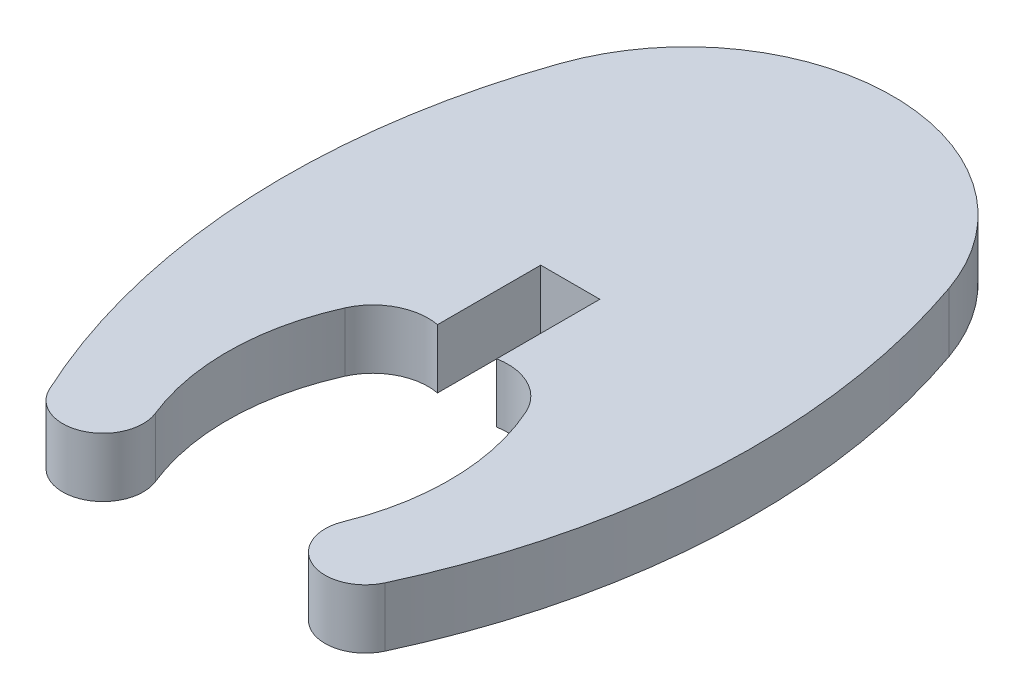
ISO-10303-21;
HEADER;
FILE_DESCRIPTION(('STEP AP214'),'2;1');
FILE_NAME('part.step','',(''),(''),'','','');
FILE_SCHEMA(('AUTOMOTIVE_DESIGN { 1 0 10303 214 1 1 1 1 }'));
ENDSEC;
DATA;
#1=APPLICATION_CONTEXT('core data for automotive mechanical design processes');
#2=APPLICATION_PROTOCOL_DEFINITION('international standard','automotive_design',2000,#1);
#3=PRODUCT_CONTEXT('',#1,'mechanical');
#4=PRODUCT('Part','Part','',(#3));
#5=PRODUCT_RELATED_PRODUCT_CATEGORY('part','',(#4));
#6=PRODUCT_DEFINITION_FORMATION('','',#4);
#7=PRODUCT_DEFINITION_CONTEXT('part definition',#1,'design');
#8=PRODUCT_DEFINITION('design','',#6,#7);
#9=PRODUCT_DEFINITION_SHAPE('','',#8);
#10=(LENGTH_UNIT() NAMED_UNIT(*) SI_UNIT(.MILLI.,.METRE.));
#11=(NAMED_UNIT(*) PLANE_ANGLE_UNIT() SI_UNIT($,.RADIAN.));
#12=(NAMED_UNIT(*) SI_UNIT($,.STERADIAN.) SOLID_ANGLE_UNIT());
#13=UNCERTAINTY_MEASURE_WITH_UNIT(LENGTH_MEASURE(1.E-05),#10,'distance_accuracy_value','');
#14=(GEOMETRIC_REPRESENTATION_CONTEXT(3) GLOBAL_UNCERTAINTY_ASSIGNED_CONTEXT((#13)) GLOBAL_UNIT_ASSIGNED_CONTEXT((#10,
#11,#12)) REPRESENTATION_CONTEXT('',''));
#15=CARTESIAN_POINT('',(0.,0.,0.));
#16=DIRECTION('',(0.,0.,1.));
#17=DIRECTION('',(1.,0.,0.));
#18=AXIS2_PLACEMENT_3D('',#15,#16,#17);
#19=CARTESIAN_POINT('',(-41929.9570312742,3.,-18428.970702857));
#20=DIRECTION('',(0.,-1.,0.));
#21=DIRECTION('',(0.,0.,-1.));
#22=AXIS2_PLACEMENT_3D('',#19,#20,#21);
#23=CYLINDRICAL_SURFACE('',#22,2.80482293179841);
#24=CARTESIAN_POINT('',(-41929.9570312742,0.,-18428.970702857));
#25=DIRECTION('',(0.,-1.,0.));
#26=DIRECTION('',(0.,0.,1.));
#27=AXIS2_PLACEMENT_3D('',#24,#25,#26);
#28=CIRCLE('',#27,2.80482293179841);
#29=CARTESIAN_POINT('',(-41932.516145,0.,-18430.118731));
#30=VERTEX_POINT('',#29);
#31=CARTESIAN_POINT('',(-41929.434079,0.,-18431.726343));
#32=VERTEX_POINT('',#31);
#33=EDGE_CURVE('E156',#30,#32,#28,.T.);
#34=ORIENTED_EDGE('',*,*,#33,.T.);
#35=DIRECTION('',(0.,-1.,0.));
#36=VECTOR('',#35,1.);
#37=CARTESIAN_POINT('',(-41929.434079,3.,-18431.726343));
#38=LINE('',#37,#36);
#39=CARTESIAN_POINT('',(-41929.434079,3.,-18431.726343));
#40=VERTEX_POINT('',#39);
#41=EDGE_CURVE('E11',#40,#32,#38,.T.);
#42=ORIENTED_EDGE('',*,*,#41,.F.);
#43=CARTESIAN_POINT('',(-41929.9570312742,3.,-18428.970702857));
#44=DIRECTION('',(0.,-1.,0.));
#45=DIRECTION('',(0.,0.,1.));
#46=AXIS2_PLACEMENT_3D('',#43,#44,#45);
#47=CIRCLE('',#46,2.80482293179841);
#48=CARTESIAN_POINT('',(-41932.516145,3.,-18430.118731));
#49=VERTEX_POINT('',#48);
#50=EDGE_CURVE('E178',#49,#40,#47,.T.);
#51=ORIENTED_EDGE('',*,*,#50,.F.);
#52=DIRECTION('',(0.,-1.,0.));
#53=VECTOR('',#52,1.);
#54=CARTESIAN_POINT('',(-41932.516145,3.,-18430.118731));
#55=LINE('',#54,#53);
#56=EDGE_CURVE('E152',#49,#30,#55,.T.);
#57=ORIENTED_EDGE('',*,*,#56,.T.);
#58=EDGE_LOOP('',(#34,#42,#51,#57));
#59=FACE_BOUND('',#58,.T.);
#60=ADVANCED_FACE('F36',(#59),#23,.F.);
#61=CARTESIAN_POINT('',(-41929.429687,3.,-18436.955078));
#62=DIRECTION('',(-0.999999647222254,0.,-0.000839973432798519));
#63=DIRECTION('',(-0.000839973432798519,0.,0.999999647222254));
#64=AXIS2_PLACEMENT_3D('',#61,#62,#63);
#65=PLANE('',#64);
#66=DIRECTION('',(0.000839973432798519,0.,-0.999999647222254));
#67=VECTOR('',#66,1.);
#68=CARTESIAN_POINT('',(-41929.429687,0.,-18436.955078));
#69=LINE('',#68,#67);
#70=CARTESIAN_POINT('',(-41929.429687,0.,-18436.955078));
#71=VERTEX_POINT('',#70);
#72=EDGE_CURVE('E159',#32,#71,#69,.T.);
#73=ORIENTED_EDGE('',*,*,#72,.T.);
#74=DIRECTION('',(0.,-1.,0.));
#75=VECTOR('',#74,1.);
#76=CARTESIAN_POINT('',(-41929.429687,3.,-18436.955078));
#77=LINE('',#76,#75);
#78=CARTESIAN_POINT('',(-41929.429687,3.,-18436.955078));
#79=VERTEX_POINT('',#78);
#80=EDGE_CURVE('E44',#79,#71,#77,.T.);
#81=ORIENTED_EDGE('',*,*,#80,.F.);
#82=DIRECTION('',(0.000839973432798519,0.,-0.999999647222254));
#83=VECTOR('',#82,1.);
#84=CARTESIAN_POINT('',(-41929.429687,3.,-18436.955078));
#85=LINE('',#84,#83);
#86=EDGE_CURVE('E107',#40,#79,#85,.T.);
#87=ORIENTED_EDGE('',*,*,#86,.F.);
#88=ORIENTED_EDGE('',*,*,#41,.T.);
#89=EDGE_LOOP('',(#73,#81,#87,#88));
#90=FACE_BOUND('',#89,.T.);
#91=ADVANCED_FACE('F256',(#90),#65,.F.);
#92=CARTESIAN_POINT('',(-41926.433594,3.,-18436.955078));
#93=DIRECTION('',(0.,0.,-1.));
#94=DIRECTION('',(-1.,0.,0.));
#95=AXIS2_PLACEMENT_3D('',#92,#93,#94);
#96=PLANE('',#95);
#97=DIRECTION('',(1.,0.,0.));
#98=VECTOR('',#97,1.);
#99=CARTESIAN_POINT('',(-41926.433594,0.,-18436.955078));
#100=LINE('',#99,#98);
#101=CARTESIAN_POINT('',(-41926.433594,0.,-18436.955078));
#102=VERTEX_POINT('',#101);
#103=EDGE_CURVE('E161',#71,#102,#100,.T.);
#104=ORIENTED_EDGE('',*,*,#103,.T.);
#105=DIRECTION('',(0.,-1.,0.));
#106=VECTOR('',#105,1.);
#107=CARTESIAN_POINT('',(-41926.433594,3.,-18436.955078));
#108=LINE('',#107,#106);
#109=CARTESIAN_POINT('',(-41926.433594,3.,-18436.955078));
#110=VERTEX_POINT('',#109);
#111=EDGE_CURVE('E197',#110,#102,#108,.T.);
#112=ORIENTED_EDGE('',*,*,#111,.F.);
#113=DIRECTION('',(1.,0.,0.));
#114=VECTOR('',#113,1.);
#115=CARTESIAN_POINT('',(-41926.433594,3.,-18436.955078));
#116=LINE('',#115,#114);
#117=EDGE_CURVE('E205',#79,#110,#116,.T.);
#118=ORIENTED_EDGE('',*,*,#117,.F.);
#119=ORIENTED_EDGE('',*,*,#80,.T.);
#120=EDGE_LOOP('',(#104,#112,#118,#119));
#121=FACE_BOUND('',#120,.T.);
#122=ADVANCED_FACE('F203',(#121),#96,.F.);
#123=CARTESIAN_POINT('',(-41926.433962,3.,-18431.7269200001));
#124=DIRECTION('',(0.999999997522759,0.,7.03880849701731E-05));
#125=DIRECTION('',(7.03880849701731E-05,0.,-0.999999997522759));
#126=AXIS2_PLACEMENT_3D('',#123,#124,#125);
#127=PLANE('',#126);
#128=DIRECTION('',(-7.03880849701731E-05,0.,0.999999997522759));
#129=VECTOR('',#128,1.);
#130=CARTESIAN_POINT('',(-41926.433962,0.,-18431.7269200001));
#131=LINE('',#130,#129);
#132=CARTESIAN_POINT('',(-41926.433962,0.,-18431.7269200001));
#133=VERTEX_POINT('',#132);
#134=EDGE_CURVE('E163',#102,#133,#131,.T.);
#135=ORIENTED_EDGE('',*,*,#134,.T.);
#136=DIRECTION('',(0.,-1.,0.));
#137=VECTOR('',#136,1.);
#138=CARTESIAN_POINT('',(-41926.433962,3.,-18431.7269200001));
#139=LINE('',#138,#137);
#140=CARTESIAN_POINT('',(-41926.433962,3.,-18431.7269200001));
#141=VERTEX_POINT('',#140);
#142=EDGE_CURVE('E194',#141,#133,#139,.T.);
#143=ORIENTED_EDGE('',*,*,#142,.F.);
#144=DIRECTION('',(-7.03880849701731E-05,0.,0.999999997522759));
#145=VECTOR('',#144,1.);
#146=CARTESIAN_POINT('',(-41926.433962,3.,-18431.7269200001));
#147=LINE('',#146,#145);
#148=EDGE_CURVE('E223',#110,#141,#147,.T.);
#149=ORIENTED_EDGE('',*,*,#148,.F.);
#150=ORIENTED_EDGE('',*,*,#111,.T.);
#151=EDGE_LOOP('',(#135,#143,#149,#150));
#152=FACE_BOUND('',#151,.T.);
#153=ADVANCED_FACE('F214',(#152),#127,.F.);
#154=CARTESIAN_POINT('',(-41925.91331424,3.,-18428.9703118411));
#155=DIRECTION('',(0.,-1.,0.));
#156=DIRECTION('',(0.,0.,-1.));
#157=AXIS2_PLACEMENT_3D('',#154,#155,#156);
#158=CYLINDRICAL_SURFACE('',#157,2.80534536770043);
#159=CARTESIAN_POINT('',(-41925.91331424,0.,-18428.9703118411));
#160=DIRECTION('',(0.,-1.,0.));
#161=DIRECTION('',(0.,0.,1.));
#162=AXIS2_PLACEMENT_3D('',#159,#160,#161);
#163=CIRCLE('',#162,2.80534536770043);
#164=CARTESIAN_POINT('',(-41923.352011,0.,-18430.114728));
#165=VERTEX_POINT('',#164);
#166=EDGE_CURVE('E165',#133,#165,#163,.T.);
#167=ORIENTED_EDGE('',*,*,#166,.T.);
#168=DIRECTION('',(0.,-1.,0.));
#169=VECTOR('',#168,1.);
#170=CARTESIAN_POINT('',(-41923.352011,3.,-18430.114728));
#171=LINE('',#170,#169);
#172=CARTESIAN_POINT('',(-41923.352011,3.,-18430.114728));
#173=VERTEX_POINT('',#172);
#174=EDGE_CURVE('E191',#173,#165,#171,.T.);
#175=ORIENTED_EDGE('',*,*,#174,.F.);
#176=CARTESIAN_POINT('',(-41925.91331424,3.,-18428.9703118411));
#177=DIRECTION('',(0.,-1.,0.));
#178=DIRECTION('',(0.,0.,1.));
#179=AXIS2_PLACEMENT_3D('',#176,#177,#178);
#180=CIRCLE('',#179,2.80534536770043);
#181=EDGE_CURVE('E220',#141,#173,#180,.T.);
#182=ORIENTED_EDGE('',*,*,#181,.F.);
#183=ORIENTED_EDGE('',*,*,#142,.T.);
#184=EDGE_LOOP('',(#167,#175,#182,#183));
#185=FACE_BOUND('',#184,.T.);
#186=ADVANCED_FACE('F218',(#185),#158,.F.);
#187=CARTESIAN_POINT('',(-41934.351555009,3.,-18425.1910314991));
#188=DIRECTION('',(0.,-1.,0.));
#189=DIRECTION('',(0.,0.,-1.));
#190=AXIS2_PLACEMENT_3D('',#187,#188,#189);
#191=CYLINDRICAL_SURFACE('',#190,12.0512553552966);
#192=CARTESIAN_POINT('',(-41934.351555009,0.,-18425.1910314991));
#193=DIRECTION('',(0.,-1.,0.));
#194=DIRECTION('',(0.,0.,1.));
#195=AXIS2_PLACEMENT_3D('',#192,#193,#194);
#196=CIRCLE('',#195,12.0512553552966);
#197=CARTESIAN_POINT('',(-41923.17591,0.,-18420.681296));
#198=VERTEX_POINT('',#197);
#199=EDGE_CURVE('E167',#165,#198,#196,.T.);
#200=ORIENTED_EDGE('',*,*,#199,.T.);
#201=DIRECTION('',(0.,-1.,0.));
#202=VECTOR('',#201,1.);
#203=CARTESIAN_POINT('',(-41923.17591,3.,-18420.681296));
#204=LINE('',#203,#202);
#205=CARTESIAN_POINT('',(-41923.17591,3.,-18420.681296));
#206=VERTEX_POINT('',#205);
#207=EDGE_CURVE('E188',#206,#198,#204,.T.);
#208=ORIENTED_EDGE('',*,*,#207,.F.);
#209=CARTESIAN_POINT('',(-41934.351555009,3.,-18425.1910314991));
#210=DIRECTION('',(0.,-1.,0.));
#211=DIRECTION('',(0.,0.,1.));
#212=AXIS2_PLACEMENT_3D('',#209,#210,#211);
#213=CIRCLE('',#212,12.0512553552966);
#214=EDGE_CURVE('E222',#173,#206,#213,.T.);
#215=ORIENTED_EDGE('',*,*,#214,.F.);
#216=ORIENTED_EDGE('',*,*,#174,.T.);
#217=EDGE_LOOP('',(#200,#208,#215,#216));
#218=FACE_BOUND('',#217,.T.);
#219=ADVANCED_FACE('F269',(#218),#191,.F.);
#220=CARTESIAN_POINT('',(-41921.2826689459,3.,-18419.9185842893));
#221=DIRECTION('',(0.,-1.,0.));
#222=DIRECTION('',(0.,0.,-1.));
#223=AXIS2_PLACEMENT_3D('',#220,#221,#222);
#224=CYLINDRICAL_SURFACE('',#223,2.04110039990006);
#225=CARTESIAN_POINT('',(-41921.2826689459,0.,-18419.9185842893));
#226=DIRECTION('',(0.,1.,0.));
#227=DIRECTION('',(0.,0.,1.));
#228=AXIS2_PLACEMENT_3D('',#225,#226,#227);
#229=CIRCLE('',#228,2.04110039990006);
#230=CARTESIAN_POINT('',(-41919.431945,0.,-18419.057822));
#231=VERTEX_POINT('',#230);
#232=EDGE_CURVE('E169',#198,#231,#229,.T.);
#233=ORIENTED_EDGE('',*,*,#232,.T.);
#234=DIRECTION('',(0.,-1.,0.));
#235=VECTOR('',#234,1.);
#236=CARTESIAN_POINT('',(-41919.431945,3.,-18419.057822));
#237=LINE('',#236,#235);
#238=CARTESIAN_POINT('',(-41919.431945,3.,-18419.057822));
#239=VERTEX_POINT('',#238);
#240=EDGE_CURVE('E185',#239,#231,#237,.T.);
#241=ORIENTED_EDGE('',*,*,#240,.F.);
#242=CARTESIAN_POINT('',(-41921.2826689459,3.,-18419.9185842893));
#243=DIRECTION('',(0.,1.,0.));
#244=DIRECTION('',(0.,0.,1.));
#245=AXIS2_PLACEMENT_3D('',#242,#243,#244);
#246=CIRCLE('',#245,2.04110039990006);
#247=EDGE_CURVE('E225',#206,#239,#246,.T.);
#248=ORIENTED_EDGE('',*,*,#247,.F.);
#249=ORIENTED_EDGE('',*,*,#207,.T.);
#250=EDGE_LOOP('',(#233,#241,#248,#249));
#251=FACE_BOUND('',#250,.T.);
#252=ADVANCED_FACE('F272',(#251),#224,.T.);
#253=CARTESIAN_POINT('',(-41952.3709491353,3.,-18434.3583582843));
#254=DIRECTION('',(0.,-1.,0.));
#255=DIRECTION('',(0.,0.,-1.));
#256=AXIS2_PLACEMENT_3D('',#253,#254,#255);
#257=CYLINDRICAL_SURFACE('',#256,36.3192015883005);
#258=CARTESIAN_POINT('',(-41952.3709491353,0.,-18434.3583582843));
#259=DIRECTION('',(0.,1.,0.));
#260=DIRECTION('',(0.,0.,1.));
#261=AXIS2_PLACEMENT_3D('',#258,#259,#260);
#262=CIRCLE('',#261,36.3192015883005);
#263=CARTESIAN_POINT('',(-41918.066692,0.,-18446.2874129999));
#264=VERTEX_POINT('',#263);
#265=EDGE_CURVE('E171',#231,#264,#262,.T.);
#266=ORIENTED_EDGE('',*,*,#265,.T.);
#267=DIRECTION('',(0.,-1.,0.));
#268=VECTOR('',#267,1.);
#269=CARTESIAN_POINT('',(-41918.066692,3.,-18446.2874129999));
#270=LINE('',#269,#268);
#271=CARTESIAN_POINT('',(-41918.066692,3.,-18446.2874129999));
#272=VERTEX_POINT('',#271);
#273=EDGE_CURVE('E182',#272,#264,#270,.T.);
#274=ORIENTED_EDGE('',*,*,#273,.F.);
#275=CARTESIAN_POINT('',(-41952.3709491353,3.,-18434.3583582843));
#276=DIRECTION('',(0.,1.,0.));
#277=DIRECTION('',(0.,0.,1.));
#278=AXIS2_PLACEMENT_3D('',#275,#276,#277);
#279=CIRCLE('',#278,36.3192015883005);
#280=EDGE_CURVE('E231',#239,#272,#279,.T.);
#281=ORIENTED_EDGE('',*,*,#280,.F.);
#282=ORIENTED_EDGE('',*,*,#240,.T.);
#283=EDGE_LOOP('',(#266,#274,#281,#282));
#284=FACE_BOUND('',#283,.T.);
#285=ADVANCED_FACE('F237',(#284),#257,.T.);
#286=CARTESIAN_POINT('',(-41927.9320170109,3.,-18442.8554694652));
#287=DIRECTION('',(0.,-1.,0.));
#288=DIRECTION('',(0.,0.,-1.));
#289=AXIS2_PLACEMENT_3D('',#286,#287,#288);
#290=CYLINDRICAL_SURFACE('',#289,10.4452321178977);
#291=CARTESIAN_POINT('',(-41927.9320170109,0.,-18442.8554694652));
#292=DIRECTION('',(0.,1.,0.));
#293=DIRECTION('',(0.,0.,1.));
#294=AXIS2_PLACEMENT_3D('',#291,#292,#293);
#295=CIRCLE('',#294,10.4452321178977);
#296=CARTESIAN_POINT('',(-41937.7959589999,0.,-18446.291386));
#297=VERTEX_POINT('',#296);
#298=EDGE_CURVE('E173',#264,#297,#295,.T.);
#299=ORIENTED_EDGE('',*,*,#298,.T.);
#300=DIRECTION('',(0.,-1.,0.));
#301=VECTOR('',#300,1.);
#302=CARTESIAN_POINT('',(-41937.7959589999,3.,-18446.291386));
#303=LINE('',#302,#301);
#304=CARTESIAN_POINT('',(-41937.7959589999,3.,-18446.291386));
#305=VERTEX_POINT('',#304);
#306=EDGE_CURVE('E147',#305,#297,#303,.T.);
#307=ORIENTED_EDGE('',*,*,#306,.F.);
#308=CARTESIAN_POINT('',(-41927.9320170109,3.,-18442.8554694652));
#309=DIRECTION('',(0.,1.,0.));
#310=DIRECTION('',(0.,0.,1.));
#311=AXIS2_PLACEMENT_3D('',#308,#309,#310);
#312=CIRCLE('',#311,10.4452321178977);
#313=EDGE_CURVE('E138',#272,#305,#312,.T.);
#314=ORIENTED_EDGE('',*,*,#313,.F.);
#315=ORIENTED_EDGE('',*,*,#273,.T.);
#316=EDGE_LOOP('',(#299,#307,#314,#315));
#317=FACE_BOUND('',#316,.T.);
#318=ADVANCED_FACE('F241',(#317),#290,.T.);
#319=CARTESIAN_POINT('',(-41903.5005204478,3.,-18434.3522409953));
#320=DIRECTION('',(0.,-1.,0.));
#321=DIRECTION('',(0.,0.,-1.));
#322=AXIS2_PLACEMENT_3D('',#319,#320,#321);
#323=CYLINDRICAL_SURFACE('',#322,36.3141885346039);
#324=CARTESIAN_POINT('',(-41903.5005204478,0.,-18434.3522409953));
#325=DIRECTION('',(0.,1.,0.));
#326=DIRECTION('',(0.,0.,1.));
#327=AXIS2_PLACEMENT_3D('',#324,#325,#326);
#328=CIRCLE('',#327,36.3141885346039);
#329=CARTESIAN_POINT('',(-41936.4390910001,0.,-18419.062674));
#330=VERTEX_POINT('',#329);
#331=EDGE_CURVE('E146',#297,#330,#328,.T.);
#332=ORIENTED_EDGE('',*,*,#331,.T.);
#333=DIRECTION('',(0.,-1.,0.));
#334=VECTOR('',#333,1.);
#335=CARTESIAN_POINT('',(-41936.4390910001,3.,-18419.062674));
#336=LINE('',#335,#334);
#337=CARTESIAN_POINT('',(-41936.4390910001,3.,-18419.062674));
#338=VERTEX_POINT('',#337);
#339=EDGE_CURVE('E143',#338,#330,#336,.T.);
#340=ORIENTED_EDGE('',*,*,#339,.F.);
#341=CARTESIAN_POINT('',(-41903.5005204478,3.,-18434.3522409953));
#342=DIRECTION('',(0.,1.,0.));
#343=DIRECTION('',(0.,0.,1.));
#344=AXIS2_PLACEMENT_3D('',#341,#342,#343);
#345=CIRCLE('',#344,36.3141885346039);
#346=EDGE_CURVE('E132',#305,#338,#345,.T.);
#347=ORIENTED_EDGE('',*,*,#346,.F.);
#348=ORIENTED_EDGE('',*,*,#306,.T.);
#349=EDGE_LOOP('',(#332,#340,#347,#348));
#350=FACE_BOUND('',#349,.T.);
#351=ADVANCED_FACE('F144',(#350),#323,.T.);
#352=CARTESIAN_POINT('',(-41934.5868084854,3.,-18419.9214976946));
#353=DIRECTION('',(0.,-1.,0.));
#354=DIRECTION('',(0.,0.,-1.));
#355=AXIS2_PLACEMENT_3D('',#352,#353,#354);
#356=CYLINDRICAL_SURFACE('',#355,2.04169749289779);
#357=CARTESIAN_POINT('',(-41934.5868084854,0.,-18419.9214976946));
#358=DIRECTION('',(0.,1.,0.));
#359=DIRECTION('',(0.,0.,1.));
#360=AXIS2_PLACEMENT_3D('',#357,#358,#359);
#361=CIRCLE('',#360,2.04169749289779);
#362=CARTESIAN_POINT('',(-41932.693044,0.,-18420.684508));
#363=VERTEX_POINT('',#362);
#364=EDGE_CURVE('E93',#330,#363,#361,.T.);
#365=ORIENTED_EDGE('',*,*,#364,.T.);
#366=DIRECTION('',(0.,-1.,0.));
#367=VECTOR('',#366,1.);
#368=CARTESIAN_POINT('',(-41932.693044,3.,-18420.684508));
#369=LINE('',#368,#367);
#370=CARTESIAN_POINT('',(-41932.693044,3.,-18420.684508));
#371=VERTEX_POINT('',#370);
#372=EDGE_CURVE('E148',#371,#363,#369,.T.);
#373=ORIENTED_EDGE('',*,*,#372,.F.);
#374=CARTESIAN_POINT('',(-41934.5868084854,3.,-18419.9214976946));
#375=DIRECTION('',(0.,1.,0.));
#376=DIRECTION('',(0.,0.,1.));
#377=AXIS2_PLACEMENT_3D('',#374,#375,#376);
#378=CIRCLE('',#377,2.04169749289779);
#379=EDGE_CURVE('E136',#338,#371,#378,.T.);
#380=ORIENTED_EDGE('',*,*,#379,.F.);
#381=ORIENTED_EDGE('',*,*,#339,.T.);
#382=EDGE_LOOP('',(#365,#373,#380,#381));
#383=FACE_BOUND('',#382,.T.);
#384=ADVANCED_FACE('F150',(#383),#356,.T.);
#385=CARTESIAN_POINT('',(-41921.5155455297,3.,-18425.1936912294));
#386=DIRECTION('',(0.,-1.,0.));
#387=DIRECTION('',(0.,0.,-1.));
#388=AXIS2_PLACEMENT_3D('',#385,#386,#387);
#389=CYLINDRICAL_SURFACE('',#388,12.0527675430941);
#390=CARTESIAN_POINT('',(-41921.5155455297,0.,-18425.1936912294));
#391=DIRECTION('',(0.,-1.,0.));
#392=DIRECTION('',(0.,0.,1.));
#393=AXIS2_PLACEMENT_3D('',#390,#391,#392);
#394=CIRCLE('',#393,12.0527675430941);
#395=EDGE_CURVE('E99',#363,#30,#394,.T.);
#396=ORIENTED_EDGE('',*,*,#395,.T.);
#397=ORIENTED_EDGE('',*,*,#56,.F.);
#398=CARTESIAN_POINT('',(-41921.5155455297,3.,-18425.1936912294));
#399=DIRECTION('',(0.,-1.,0.));
#400=DIRECTION('',(0.,0.,1.));
#401=AXIS2_PLACEMENT_3D('',#398,#399,#400);
#402=CIRCLE('',#401,12.0527675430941);
#403=EDGE_CURVE('E52',#371,#49,#402,.T.);
#404=ORIENTED_EDGE('',*,*,#403,.F.);
#405=ORIENTED_EDGE('',*,*,#372,.T.);
#406=EDGE_LOOP('',(#396,#397,#404,#405));
#407=FACE_BOUND('',#406,.T.);
#408=ADVANCED_FACE('F245',(#407),#389,.F.);
#409=CARTESIAN_POINT('',(-41929.9570312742,3.,-18428.970702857));
#410=DIRECTION('',(0.,1.,0.));
#411=DIRECTION('',(0.,0.,1.));
#412=AXIS2_PLACEMENT_3D('',#409,#410,#411);
#413=PLANE('',#412);
#414=ORIENTED_EDGE('',*,*,#50,.T.);
#415=ORIENTED_EDGE('',*,*,#86,.T.);
#416=ORIENTED_EDGE('',*,*,#117,.T.);
#417=ORIENTED_EDGE('',*,*,#148,.T.);
#418=ORIENTED_EDGE('',*,*,#181,.T.);
#419=ORIENTED_EDGE('',*,*,#214,.T.);
#420=ORIENTED_EDGE('',*,*,#247,.T.);
#421=ORIENTED_EDGE('',*,*,#280,.T.);
#422=ORIENTED_EDGE('',*,*,#313,.T.);
#423=ORIENTED_EDGE('',*,*,#346,.T.);
#424=ORIENTED_EDGE('',*,*,#379,.T.);
#425=ORIENTED_EDGE('',*,*,#403,.T.);
#426=EDGE_LOOP('',(#414,#415,#416,#417,#418,#419,#420,#421,#422,#423,#424,#425));
#427=FACE_BOUND('',#426,.T.);
#428=ADVANCED_FACE('F134',(#427),#413,.T.);
#429=CARTESIAN_POINT('',(-41929.9570312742,0.,-18428.970702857));
#430=DIRECTION('',(0.,1.,0.));
#431=DIRECTION('',(0.,0.,1.));
#432=AXIS2_PLACEMENT_3D('',#429,#430,#431);
#433=PLANE('',#432);
#434=ORIENTED_EDGE('',*,*,#33,.F.);
#435=ORIENTED_EDGE('',*,*,#395,.F.);
#436=ORIENTED_EDGE('',*,*,#364,.F.);
#437=ORIENTED_EDGE('',*,*,#331,.F.);
#438=ORIENTED_EDGE('',*,*,#298,.F.);
#439=ORIENTED_EDGE('',*,*,#265,.F.);
#440=ORIENTED_EDGE('',*,*,#232,.F.);
#441=ORIENTED_EDGE('',*,*,#199,.F.);
#442=ORIENTED_EDGE('',*,*,#166,.F.);
#443=ORIENTED_EDGE('',*,*,#134,.F.);
#444=ORIENTED_EDGE('',*,*,#103,.F.);
#445=ORIENTED_EDGE('',*,*,#72,.F.);
#446=EDGE_LOOP('',(#434,#435,#436,#437,#438,#439,#440,#441,#442,#443,#444,#445));
#447=FACE_BOUND('',#446,.T.);
#448=ADVANCED_FACE('F209',(#447),#433,.F.);
#449=CLOSED_SHELL('',(#60,#91,#122,#153,#186,#219,#252,#285,#318,#351,#384,#408,#428,#448));
#450=MANIFOLD_SOLID_BREP('B2',#449);
#451=ADVANCED_BREP_SHAPE_REPRESENTATION('',(#18,#450),#14);
#452=SHAPE_DEFINITION_REPRESENTATION(#9,#451);
ENDSEC;
END-ISO-10303-21;
